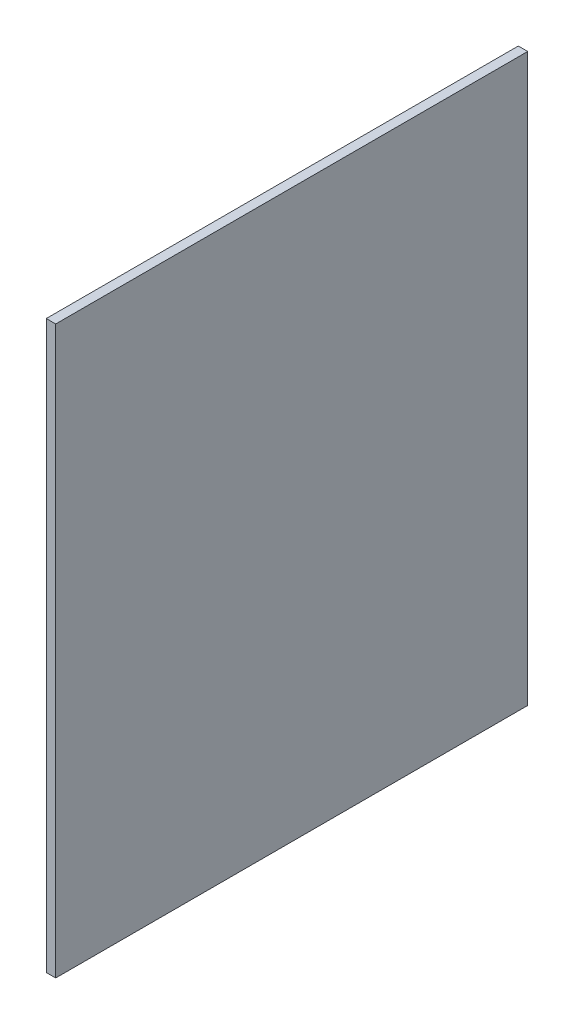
ISO-10303-21;
HEADER;
FILE_DESCRIPTION(('STEP AP214'),'2;1');
FILE_NAME('part.step','',(''),(''),'','','');
FILE_SCHEMA(('AUTOMOTIVE_DESIGN { 1 0 10303 214 1 1 1 1 }'));
ENDSEC;
DATA;
#1=APPLICATION_CONTEXT('core data for automotive mechanical design processes');
#2=APPLICATION_PROTOCOL_DEFINITION('international standard','automotive_design',2000,#1);
#3=PRODUCT_CONTEXT('',#1,'mechanical');
#4=PRODUCT('Part','Part','',(#3));
#5=PRODUCT_RELATED_PRODUCT_CATEGORY('part','',(#4));
#6=PRODUCT_DEFINITION_FORMATION('','',#4);
#7=PRODUCT_DEFINITION_CONTEXT('part definition',#1,'design');
#8=PRODUCT_DEFINITION('design','',#6,#7);
#9=PRODUCT_DEFINITION_SHAPE('','',#8);
#10=(LENGTH_UNIT() NAMED_UNIT(*) SI_UNIT(.MILLI.,.METRE.));
#11=(NAMED_UNIT(*) PLANE_ANGLE_UNIT() SI_UNIT($,.RADIAN.));
#12=(NAMED_UNIT(*) SI_UNIT($,.STERADIAN.) SOLID_ANGLE_UNIT());
#13=UNCERTAINTY_MEASURE_WITH_UNIT(LENGTH_MEASURE(1.E-05),#10,'distance_accuracy_value','');
#14=(GEOMETRIC_REPRESENTATION_CONTEXT(3) GLOBAL_UNCERTAINTY_ASSIGNED_CONTEXT((#13)) GLOBAL_UNIT_ASSIGNED_CONTEXT((#10,
#11,#12)) REPRESENTATION_CONTEXT('',''));
#15=CARTESIAN_POINT('',(0.,0.,0.));
#16=DIRECTION('',(0.,0.,1.));
#17=DIRECTION('',(1.,0.,0.));
#18=AXIS2_PLACEMENT_3D('',#15,#16,#17);
#19=CARTESIAN_POINT('',(-50.5375308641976,299.73164021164,300.));
#20=DIRECTION('',(1.,0.,0.));
#21=DIRECTION('',(0.,1.,0.));
#22=AXIS2_PLACEMENT_3D('',#19,#20,#21);
#23=PLANE('',#22);
#24=DIRECTION('',(0.,-1.,0.));
#25=VECTOR('',#24,1.);
#26=CARTESIAN_POINT('',(-50.5375308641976,299.73164021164,0.));
#27=LINE('',#26,#25);
#28=CARTESIAN_POINT('',(-50.5375308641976,299.73164021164,0.));
#29=VERTEX_POINT('',#28);
#30=CARTESIAN_POINT('',(-50.5375308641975,-60.2683597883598,0.));
#31=VERTEX_POINT('',#30);
#32=EDGE_CURVE('E74',#29,#31,#27,.T.);
#33=ORIENTED_EDGE('',*,*,#32,.T.);
#34=DIRECTION('',(0.,0.,-1.));
#35=VECTOR('',#34,1.);
#36=CARTESIAN_POINT('',(-50.5375308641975,-60.2683597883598,300.));
#37=LINE('',#36,#35);
#38=CARTESIAN_POINT('',(-50.5375308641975,-60.2683597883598,300.));
#39=VERTEX_POINT('',#38);
#40=EDGE_CURVE('E11',#39,#31,#37,.T.);
#41=ORIENTED_EDGE('',*,*,#40,.F.);
#42=DIRECTION('',(0.,-1.,0.));
#43=VECTOR('',#42,1.);
#44=CARTESIAN_POINT('',(-50.5375308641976,299.73164021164,300.));
#45=LINE('',#44,#43);
#46=CARTESIAN_POINT('',(-50.5375308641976,299.73164021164,300.));
#47=VERTEX_POINT('',#46);
#48=EDGE_CURVE('E92',#47,#39,#45,.T.);
#49=ORIENTED_EDGE('',*,*,#48,.F.);
#50=DIRECTION('',(0.,0.,-1.));
#51=VECTOR('',#50,1.);
#52=CARTESIAN_POINT('',(-50.5375308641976,299.73164021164,300.));
#53=LINE('',#52,#51);
#54=EDGE_CURVE('E86',#47,#29,#53,.T.);
#55=ORIENTED_EDGE('',*,*,#54,.T.);
#56=EDGE_LOOP('',(#33,#41,#49,#55));
#57=FACE_BOUND('',#56,.T.);
#58=ADVANCED_FACE('F30',(#57),#23,.F.);
#59=CARTESIAN_POINT('',(-50.5375308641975,-60.2683597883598,300.));
#60=DIRECTION('',(0.,1.,0.));
#61=DIRECTION('',(0.,0.,1.));
#62=AXIS2_PLACEMENT_3D('',#59,#60,#61);
#63=PLANE('',#62);
#64=DIRECTION('',(1.,0.,0.));
#65=VECTOR('',#64,1.);
#66=CARTESIAN_POINT('',(-50.5375308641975,-60.2683597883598,0.));
#67=LINE('',#66,#65);
#68=CARTESIAN_POINT('',(-44.5375308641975,-60.2683597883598,0.));
#69=VERTEX_POINT('',#68);
#70=EDGE_CURVE('E70',#31,#69,#67,.T.);
#71=ORIENTED_EDGE('',*,*,#70,.T.);
#72=DIRECTION('',(0.,0.,-1.));
#73=VECTOR('',#72,1.);
#74=CARTESIAN_POINT('',(-44.5375308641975,-60.2683597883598,300.));
#75=LINE('',#74,#73);
#76=CARTESIAN_POINT('',(-44.5375308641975,-60.2683597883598,300.));
#77=VERTEX_POINT('',#76);
#78=EDGE_CURVE('E37',#77,#69,#75,.T.);
#79=ORIENTED_EDGE('',*,*,#78,.F.);
#80=DIRECTION('',(1.,0.,0.));
#81=VECTOR('',#80,1.);
#82=CARTESIAN_POINT('',(-50.5375308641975,-60.2683597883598,300.));
#83=LINE('',#82,#81);
#84=EDGE_CURVE('E82',#39,#77,#83,.T.);
#85=ORIENTED_EDGE('',*,*,#84,.F.);
#86=ORIENTED_EDGE('',*,*,#40,.T.);
#87=EDGE_LOOP('',(#71,#79,#85,#86));
#88=FACE_BOUND('',#87,.T.);
#89=ADVANCED_FACE('F81',(#88),#63,.F.);
#90=CARTESIAN_POINT('',(-44.5375308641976,299.73164021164,300.));
#91=DIRECTION('',(-1.,0.,0.));
#92=DIRECTION('',(0.,-1.,0.));
#93=AXIS2_PLACEMENT_3D('',#90,#91,#92);
#94=PLANE('',#93);
#95=DIRECTION('',(0.,1.,0.));
#96=VECTOR('',#95,1.);
#97=CARTESIAN_POINT('',(-44.5375308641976,299.73164021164,0.));
#98=LINE('',#97,#96);
#99=CARTESIAN_POINT('',(-44.5375308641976,299.73164021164,0.));
#100=VERTEX_POINT('',#99);
#101=EDGE_CURVE('E75',#69,#100,#98,.T.);
#102=ORIENTED_EDGE('',*,*,#101,.T.);
#103=DIRECTION('',(0.,0.,-1.));
#104=VECTOR('',#103,1.);
#105=CARTESIAN_POINT('',(-44.5375308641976,299.73164021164,300.));
#106=LINE('',#105,#104);
#107=CARTESIAN_POINT('',(-44.5375308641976,299.73164021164,300.));
#108=VERTEX_POINT('',#107);
#109=EDGE_CURVE('E98',#108,#100,#106,.T.);
#110=ORIENTED_EDGE('',*,*,#109,.F.);
#111=DIRECTION('',(0.,1.,0.));
#112=VECTOR('',#111,1.);
#113=CARTESIAN_POINT('',(-44.5375308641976,299.73164021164,300.));
#114=LINE('',#113,#112);
#115=EDGE_CURVE('E49',#77,#108,#114,.T.);
#116=ORIENTED_EDGE('',*,*,#115,.F.);
#117=ORIENTED_EDGE('',*,*,#78,.T.);
#118=EDGE_LOOP('',(#102,#110,#116,#117));
#119=FACE_BOUND('',#118,.T.);
#120=ADVANCED_FACE('F101',(#119),#94,.F.);
#121=CARTESIAN_POINT('',(-50.5375308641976,299.73164021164,300.));
#122=DIRECTION('',(0.,-1.,0.));
#123=DIRECTION('',(0.,0.,-1.));
#124=AXIS2_PLACEMENT_3D('',#121,#122,#123);
#125=PLANE('',#124);
#126=DIRECTION('',(-1.,0.,0.));
#127=VECTOR('',#126,1.);
#128=CARTESIAN_POINT('',(-50.5375308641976,299.73164021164,0.));
#129=LINE('',#128,#127);
#130=EDGE_CURVE('E90',#100,#29,#129,.T.);
#131=ORIENTED_EDGE('',*,*,#130,.T.);
#132=ORIENTED_EDGE('',*,*,#54,.F.);
#133=DIRECTION('',(-1.,0.,0.));
#134=VECTOR('',#133,1.);
#135=CARTESIAN_POINT('',(-50.5375308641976,299.73164021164,300.));
#136=LINE('',#135,#134);
#137=EDGE_CURVE('E44',#108,#47,#136,.T.);
#138=ORIENTED_EDGE('',*,*,#137,.F.);
#139=ORIENTED_EDGE('',*,*,#109,.T.);
#140=EDGE_LOOP('',(#131,#132,#138,#139));
#141=FACE_BOUND('',#140,.T.);
#142=ADVANCED_FACE('F103',(#141),#125,.F.);
#143=CARTESIAN_POINT('',(-50.5375308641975,-60.2683597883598,300.));
#144=DIRECTION('',(0.,0.,1.));
#145=DIRECTION('',(1.,0.,0.));
#146=AXIS2_PLACEMENT_3D('',#143,#144,#145);
#147=PLANE('',#146);
#148=ORIENTED_EDGE('',*,*,#48,.T.);
#149=ORIENTED_EDGE('',*,*,#84,.T.);
#150=ORIENTED_EDGE('',*,*,#115,.T.);
#151=ORIENTED_EDGE('',*,*,#137,.T.);
#152=EDGE_LOOP('',(#148,#149,#150,#151));
#153=FACE_BOUND('',#152,.T.);
#154=ADVANCED_FACE('F104',(#153),#147,.T.);
#155=CARTESIAN_POINT('',(-50.5375308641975,-60.2683597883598,0.));
#156=DIRECTION('',(0.,0.,1.));
#157=DIRECTION('',(1.,0.,0.));
#158=AXIS2_PLACEMENT_3D('',#155,#156,#157);
#159=PLANE('',#158);
#160=ORIENTED_EDGE('',*,*,#32,.F.);
#161=ORIENTED_EDGE('',*,*,#130,.F.);
#162=ORIENTED_EDGE('',*,*,#101,.F.);
#163=ORIENTED_EDGE('',*,*,#70,.F.);
#164=EDGE_LOOP('',(#160,#161,#162,#163));
#165=FACE_BOUND('',#164,.T.);
#166=ADVANCED_FACE('F71',(#165),#159,.F.);
#167=CLOSED_SHELL('',(#58,#89,#120,#142,#154,#166));
#168=MANIFOLD_SOLID_BREP('B2',#167);
#169=ADVANCED_BREP_SHAPE_REPRESENTATION('',(#18,#168),#14);
#170=SHAPE_DEFINITION_REPRESENTATION(#9,#169);
ENDSEC;
END-ISO-10303-21;
